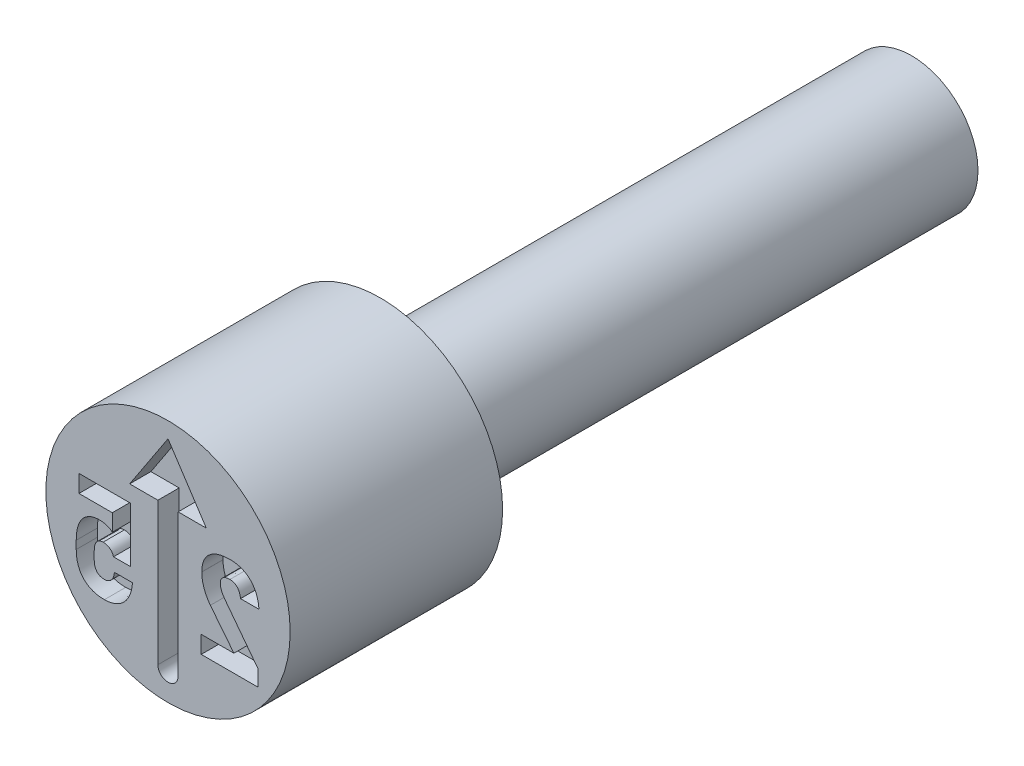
from build123d import *

# Parameters (mm, degrees)
CUT_EXTRUDE4_DEPTH = 0.4
CUT_EXTRUDE5_DEPTH = 0.4


with BuildPart() as part:
    # Sketch2 → Revolve1 (revolve)
    with BuildSketch(Plane(origin=(0, 0, 0), x_dir=(0, 0, -1), z_dir=(1, 0, 0)), mode=Mode.PRIVATE) as revolve1_sk:
        Polygon((0, 2.3), (0, 0), (14, 0), (14, 1.25), (4, 1.25), (4, 2.3), align=None)
    revolve(revolve1_sk.sketch.rotate(Axis((0, 0, -0.403888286), (0, 0, -1)), 90), axis=Axis((0, 0, -0.403888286), (0, 0, -1)))

    # Sketch3 → Cut-Extrude4 (cut)
    with BuildSketch(Plane.XY):
        with BuildLine():
            Line((0.190473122, 0.906351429), (0.190473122, -1.776161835))
            ThreePointArc((0.190473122, -1.776161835), (0, -1.966634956), (-0.190473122, -1.776161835))
            Line((-0.190473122, -1.776161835), (-0.190473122, 0.906351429))
            Line((-0.190473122, 0.906351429), (-0.721917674, 0.906351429))
            Line((-0.721917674, 0.906351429), (0, 2.002115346))
            Line((0, 2.002115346), (0.721917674, 0.906351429))
            Line((0.721917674, 0.906351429), (0.190473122, 0.906351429))
        make_face()
    extrude(amount=-CUT_EXTRUDE4_DEPTH, mode=Mode.SUBTRACT)

    # Sketch4 → Cut-Extrude5 (cut)
    with BuildSketch(Plane.XY):
        with BuildLine():
            Line((1.690282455, -0.894069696), (1.072552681, -0.081923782))
            add(Edge.make_bspline(
                [(1.072552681, -0.081923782), (1.059597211, -0.063949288), (1.034305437, -0.028859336), (1.011677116, 0.019539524), (0.997302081, 0.057489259), (0.990656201, 0.085017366), (0.985736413, 0.111340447), (0.985162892, 0.128611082), (0.984882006, 0.137069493)],
                knots=[0, 0, 0, 0, 1.660423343, 3.241491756, 3.993801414, 4.704207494, 5.365376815, 6, 6, 6, 6], degree=3))
            Line((0.984882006, 0.137069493), (0.984882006, 0.139637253))
            add(Edge.make_bspline(
                [(0.984882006, 0.139637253), (0.985374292, 0.151195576), (0.986312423, 0.173221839), (0.995369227, 0.204210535), (1.010345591, 0.231007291), (1.031323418, 0.253470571), (1.058007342, 0.27073464), (1.089482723, 0.28334591), (1.125916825, 0.29048152), (1.15175486, 0.291390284), (1.165358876, 0.291868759)],
                knots=[0, 0, 0, 0, 1.033361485, 1.969238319, 2.861873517, 3.760870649, 4.693536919, 5.686153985, 6.781734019, 8, 8, 8, 8], degree=3))
            add(Edge.make_bspline(
                [(1.165358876, 0.291868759), (1.178754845, 0.291302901), (1.204752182, 0.29020475), (1.241733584, 0.279740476), (1.274585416, 0.261975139), (1.303023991, 0.237423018), (1.326886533, 0.206536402), (1.344475, 0.169328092), (1.358639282, 0.12703926), (1.362749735, 0.0963466), (1.364910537, 0.080211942)],
                knots=[0, 0, 0, 0, 0.993701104, 1.928459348, 2.826878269, 3.748294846, 4.700551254, 5.70417143, 6.793118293, 8, 8, 8, 8], degree=3))
            Line((1.364910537, 0.080211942), (1.364910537, 0.07874465))
            Line((1.364910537, 0.07874465), (1.712658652, 0.07874465))
            Line((1.712658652, 0.07874465), (1.712658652, 0.080211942))
            add(Edge.make_bspline(
                [(1.712658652, 0.080211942), (1.710167, 0.107310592), (1.705313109, 0.160100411), (1.688808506, 0.236016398), (1.66442642, 0.305870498), (1.633274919, 0.369855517), (1.595077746, 0.427163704), (1.55075766, 0.477779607), (1.499823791, 0.520720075), (1.44315838, 0.556401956), (1.381008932, 0.584326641), (1.314135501, 0.604672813), (1.24243737, 0.616402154), (1.193157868, 0.617927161), (1.167926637, 0.618707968)],
                knots=[0, 0, 0, 0, 1.143950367, 2.228484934, 3.258162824, 4.249580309, 5.213917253, 6.146796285, 7.070112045, 8.006232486, 8.954636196, 9.927630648, 10.9389416, 12, 12, 12, 12], degree=3))
            add(Edge.make_bspline(
                [(1.167926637, 0.618707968), (1.140870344, 0.61814235), (1.088504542, 0.617047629), (1.013101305, 0.606742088), (0.943766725, 0.589592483), (0.880674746, 0.565497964), (0.824239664, 0.534525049), (0.774200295, 0.497760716), (0.731969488, 0.45377777), (0.696841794, 0.403812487), (0.669150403, 0.348057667), (0.649758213, 0.286561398), (0.637882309, 0.219817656), (0.63641996, 0.173435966), (0.6356666, 0.149541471)],
                knots=[0, 0, 0, 0, 1.208591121, 2.339154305, 3.392741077, 4.394302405, 5.348037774, 6.261656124, 7.158186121, 8.060194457, 8.981460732, 9.928425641, 10.932785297, 12, 12, 12, 12], degree=3))
            Line((0.6356666, 0.149541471), (0.6356666, 0.14807418))
            add(Edge.make_bspline(
                [(0.6356666, 0.14807418), (0.636136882, 0.127628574), (0.637078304, 0.086700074), (0.645474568, 0.025554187), (0.659203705, -0.035238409), (0.677832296, -0.095464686), (0.701094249, -0.15411899), (0.728855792, -0.210266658), (0.760551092, -0.263764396), (0.785386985, -0.296849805), (0.797802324, -0.313389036)],
                knots=[0, 0, 0, 0, 0.985191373, 1.972179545, 2.968870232, 3.986806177, 5.007996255, 6.007036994, 7.003727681, 8, 8, 8, 8], degree=3))
            Line((0.797802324, -0.313389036), (1.240924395, -0.873160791))
            Line((1.240924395, -0.873160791), (0.625762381, -0.873160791))
            Line((0.625762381, -0.873160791), (0.625762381, -1.2))
            Line((0.625762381, -1.2), (1.690282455, -1.2))
            Line((1.690282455, -1.2), (1.690282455, -0.894069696))
        make_face()
        with BuildLine():
            add(Edge.make_bspline(
                [(-1.196995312, -1.218707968), (-1.173337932, -1.217986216), (-1.127044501, -1.216573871), (-1.059565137, -1.2038949), (-0.995592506, -1.184259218), (-0.935602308, -1.15624758), (-0.880246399, -1.120659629), (-0.830748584, -1.077141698), (-0.786654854, -1.026833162), (-0.7488494, -0.969293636), (-0.717715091, -0.905138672), (-0.693476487, -0.835124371), (-0.676828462, -0.759376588), (-0.671988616, -0.706824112), (-0.669503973, -0.679845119)],
                knots=[0, 0, 0, 0, 1.013165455, 1.982590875, 2.932437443, 3.87502652, 4.811241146, 5.743574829, 6.690699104, 7.67044025, 8.68537997, 9.739549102, 10.839546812, 12, 12, 12, 12], degree=3))
            Line((-0.669503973, -0.679845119), (-0.669503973, -0.67874465))
            Line((-0.669503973, -0.67874465), (-1.008815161, -0.67874465))
            Line((-1.008815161, -0.67874465), (-1.008815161, -0.679845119))
            add(Edge.make_bspline(
                [(-1.008815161, -0.679845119), (-1.010752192, -0.695599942), (-1.01444367, -0.725624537), (-1.02775516, -0.767290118), (-1.045134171, -0.803913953), (-1.068090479, -0.834644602), (-1.095351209, -0.85959351), (-1.127654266, -0.876514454), (-1.163355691, -0.887805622), (-1.188711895, -0.888792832), (-1.201764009, -0.889300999)],
                knots=[0, 0, 0, 0, 1.202223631, 2.291125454, 3.30376979, 4.265156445, 5.185306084, 6.082185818, 7.012804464, 8, 8, 8, 8], degree=3))
            add(Edge.make_bspline(
                [(-1.201764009, -0.889300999), (-1.215911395, -0.888684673), (-1.242971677, -0.887505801), (-1.280901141, -0.876127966), (-1.313920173, -0.857911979), (-1.341193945, -0.831700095), (-1.362951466, -0.799040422), (-1.378352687, -0.75993036), (-1.387473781, -0.71499059), (-1.388371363, -0.683070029), (-1.388843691, -0.666272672)],
                knots=[0, 0, 0, 0, 1.026088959, 1.96264217, 2.850204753, 3.743092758, 4.68486217, 5.681854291, 6.780136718, 8, 8, 8, 8], degree=3))
            Line((-1.388843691, -0.666272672), (-1.388843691, -0.515508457))
            add(Edge.make_bspline(
                [(-1.388843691, -0.515508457), (-1.388481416, -0.498712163), (-1.387793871, -0.466835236), (-1.37924083, -0.422244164), (-1.365942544, -0.383339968), (-1.34630283, -0.351044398), (-1.321888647, -0.324976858), (-1.292344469, -0.306462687), (-1.258263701, -0.295527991), (-1.234126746, -0.29424692), (-1.221572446, -0.293580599)],
                knots=[0, 0, 0, 0, 1.281587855, 2.432267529, 3.454745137, 4.406485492, 5.298532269, 6.159104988, 7.042499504, 8, 8, 8, 8], degree=3))
            add(Edge.make_bspline(
                [(-1.221572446, -0.293580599), (-1.209795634, -0.293939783), (-1.186996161, -0.29463515), (-1.154168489, -0.301835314), (-1.12399662, -0.313615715), (-1.096823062, -0.330271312), (-1.072822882, -0.350684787), (-1.053063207, -0.375350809), (-1.036498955, -0.40322205), (-1.029587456, -0.424125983), (-1.026055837, -0.434807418)],
                knots=[0, 0, 0, 0, 1.085085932, 2.100686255, 3.083167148, 4.060192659, 5.028057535, 5.974180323, 6.964852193, 8, 8, 8, 8], degree=3))
            Line((-1.026055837, -0.434807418), (-0.709120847, -0.434807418))
            Line((-0.709120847, -0.434807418), (-0.709120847, 0.6))
            Line((-0.709120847, 0.6), (-1.676066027, 0.6))
            Line((-1.676066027, 0.6), (-1.676066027, 0.273160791))
            Line((-1.676066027, 0.273160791), (-1.048432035, 0.273160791))
            Line((-1.048432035, 0.273160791), (-1.048432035, -0.044874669))
            add(Edge.make_bspline(
                [(-1.048432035, -0.044874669), (-1.055261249, -0.038827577), (-1.069309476, -0.026388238), (-1.093869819, -0.010593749), (-1.121959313, 0.002821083), (-1.163407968, 0.018271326), (-1.217931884, 0.032010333), (-1.262692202, 0.034323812), (-1.284665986, 0.035459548)],
                knots=[0, 0, 0, 0, 0.643749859, 1.324243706, 2.054464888, 2.839075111, 4.448235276, 6, 6, 6, 6], degree=3))
            add(Edge.make_bspline(
                [(-1.284665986, 0.035459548), (-1.30722507, 0.03474532), (-1.350978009, 0.033360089), (-1.414088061, 0.02089961), (-1.472249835, 0.000936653), (-1.524983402, -0.027824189), (-1.572348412, -0.063871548), (-1.613488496, -0.107918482), (-1.648660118, -0.15924703), (-1.677445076, -0.217891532), (-1.700100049, -0.283338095), (-1.716555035, -0.355129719), (-1.725932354, -0.433336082), (-1.727155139, -0.487482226), (-1.727788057, -0.515508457)],
                knots=[0, 0, 0, 0, 1.012739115, 1.964189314, 2.878178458, 3.765675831, 4.65138573, 5.541464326, 6.461953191, 7.437418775, 8.467828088, 9.567356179, 10.740855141, 12, 12, 12, 12], degree=3))
            Line((-1.727788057, -0.515508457), (-1.727788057, -0.666272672))
            add(Edge.make_bspline(
                [(-1.727788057, -0.666272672), (-1.726984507, -0.694307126), (-1.725430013, -0.748540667), (-1.714313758, -0.826966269), (-1.694274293, -0.898905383), (-1.667424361, -0.964823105), (-1.632363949, -1.023409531), (-1.590381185, -1.075159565), (-1.540709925, -1.118878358), (-1.48452244, -1.155671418), (-1.421284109, -1.183889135), (-1.35200548, -1.204388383), (-1.276412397, -1.216581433), (-1.224063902, -1.217983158), (-1.196995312, -1.218707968)],
                knots=[0, 0, 0, 0, 1.159103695, 2.242322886, 3.265299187, 4.239894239, 5.17631577, 6.078070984, 6.98412447, 7.901225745, 8.844758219, 9.836512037, 10.881294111, 12, 12, 12, 12], degree=3))
        make_face()
    extrude(amount=-CUT_EXTRUDE5_DEPTH, mode=Mode.SUBTRACT)


solid = part.part
